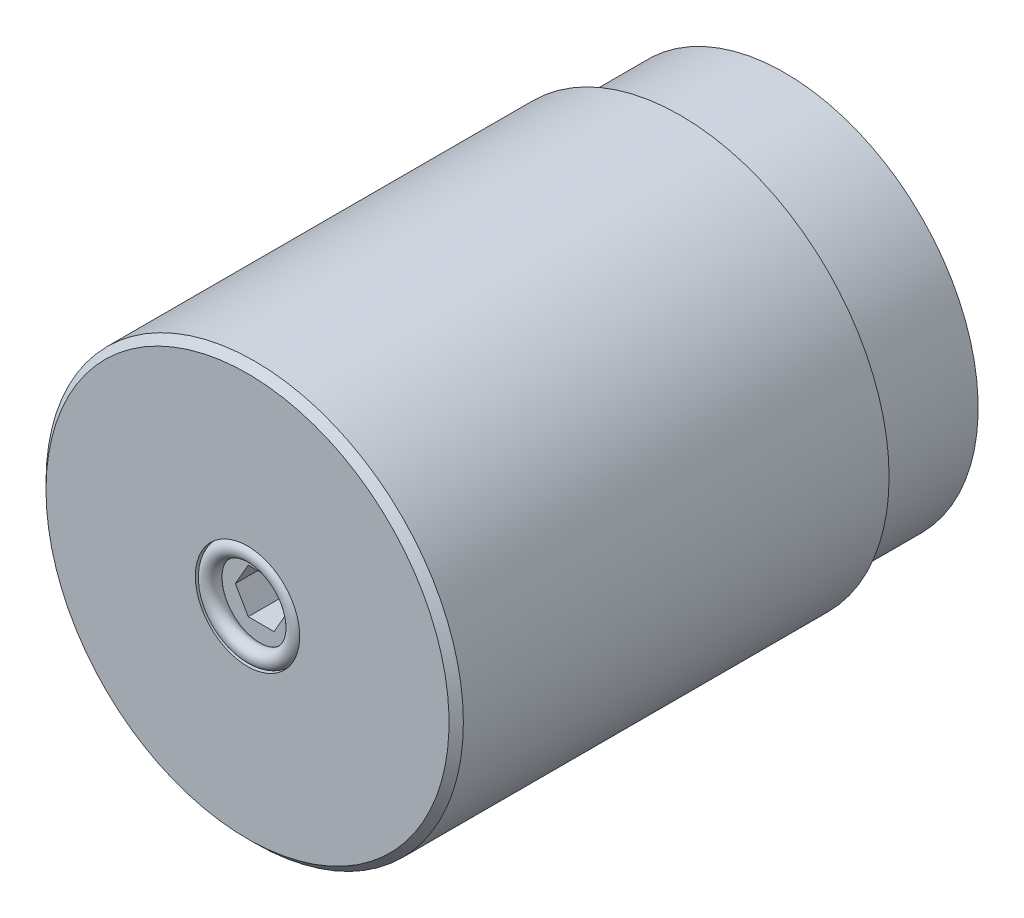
from build123d import *

# Parameters (mm, degrees)
FILLET1_R          = 0.381
CUT_EXTRUDE1_DEPTH = 6.9342
CHAMFER1_SIZE      = 0.762
CIRPATTERN1_COUNT  = 4
CIRPATTERN1_ANGLE  = 180
FILLET2_R          = 1.6002


with BuildPart() as part:
    # Sketch1 → Revolve1 (revolve)
    with BuildSketch(Plane(origin=(0, 0, 0), x_dir=(0, 0, -1), z_dir=(1, 0, 0)), mode=Mode.PRIVATE) as revolve1_sk:
        Polygon((1.4478, 0), (1.4478, 5.5499), (0, 5.5499), (0, 22.1996), (46.0502, 22.1996), (46.0502, 20.574), (57.15, 20.574), (57.15, 0), align=None)
    revolve(revolve1_sk.sketch.rotate(Axis((0, 0, 0), (0, 0, 1)), 90), axis=Axis((0, 0, 0), (0, 0, 1)))

    # Fillet1
    fillet1_edges = [part.edges().sort_by_distance(p)[0] for p in [
        (20.574, 0, -46.0502),
    ]]
    fillet(fillet1_edges, radius=FILLET1_R)

    # Sketch2 → Cut-Extrude1 (cut)
    with BuildSketch(Plane.XY.offset(-1.4478)):
        Polygon((2.742298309, 0), (1.371149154, 2.3749), (-1.371149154, 2.3749), (-2.742298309, 0), (-1.371149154, -2.3749), (1.371149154, -2.3749), align=None)
    extrude(amount=-CUT_EXTRUDE1_DEPTH, mode=Mode.SUBTRACT)

    # Sketch3 → Revolve4 (revolve)
    with BuildSketch(Plane(origin=(0, 0, 0), x_dir=(0, 0, -1), z_dir=(1, 0, 0)), mode=Mode.PRIVATE) as revolve4_sk:
        with BuildLine():
            Line((1.4478, 5.117535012), (1.4478, 4.201724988))
            ThreePointArc((1.4478, 4.201724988), (-0.2032, 4.65963), (1.4478, 5.117535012))
        make_face()
    revolve(revolve4_sk.sketch.rotate(Axis((0, 0, 0), (0, 0, -1)), 90), axis=Axis((0, 0, 0), (0, 0, -1)))

    # Chamfer1
    chamfer1_edges = [part.edges().sort_by_distance(p)[0] for p in [
        (22.1996, 0, 0),
    ]]
    chamfer(chamfer1_edges, length=CHAMFER1_SIZE)

    # Sketch4 → 1_8 _0.125_ Diameter Hole1 (revolve, cut)
    with BuildSketch(Plane(origin=(15.875, 0, -57.15), x_dir=(0, 1, 0), z_dir=(1, 0, 0))):
        Polygon((0, 0), (0, 4.255866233), (1.5875, 3.302), (1.5875, 0), align=None)
    f_1_8_0_125_diameter_hole1 = revolve(axis=Axis((15.875, 0, -63.5), (0, 0, 1)), mode=Mode.SUBTRACT)

    # CirPattern1: 1_8 _0.125_ Diameter Hole1 ×4 about axis
    cirpattern1_axis = Axis((0, 0, 0), (0, 0, -1))
    for i in range(1, CIRPATTERN1_COUNT):
        add(f_1_8_0_125_diameter_hole1.rotate(cirpattern1_axis, i * CIRPATTERN1_ANGLE / (CIRPATTERN1_COUNT - 1)), mode=Mode.SUBTRACT)

    # Sketch6 → Cut-Revolve1 (revolve, cut)
    with BuildSketch(Plane(origin=(0, 0, 0), x_dir=(0, 0, -1), z_dir=(1, 0, 0))):
        with BuildLine():
            Line((57.15, 12.7), (54.281904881, 12.7))
            ThreePointArc((54.281904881, 12.7), (52.209547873, 13.585330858), (49.9872, 13.959020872))
            Line((49.9872, 13.959020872), (49.9872, 4.445))
            Line((49.9872, 4.445), (57.15, 4.445))
            Line((57.15, 4.445), (57.15, 12.7))
        make_face()
    revolve(axis=Axis((0, 4.445, -59.433947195), (0, 0, 1)), mode=Mode.SUBTRACT)

    # Fillet2
    fillet2_edges = [part.edges().sort_by_distance(p)[0] for p in [
        (0, -3.81, -57.15),
    ]]
    fillet(fillet2_edges, radius=FILLET2_R)


solid = part.part
